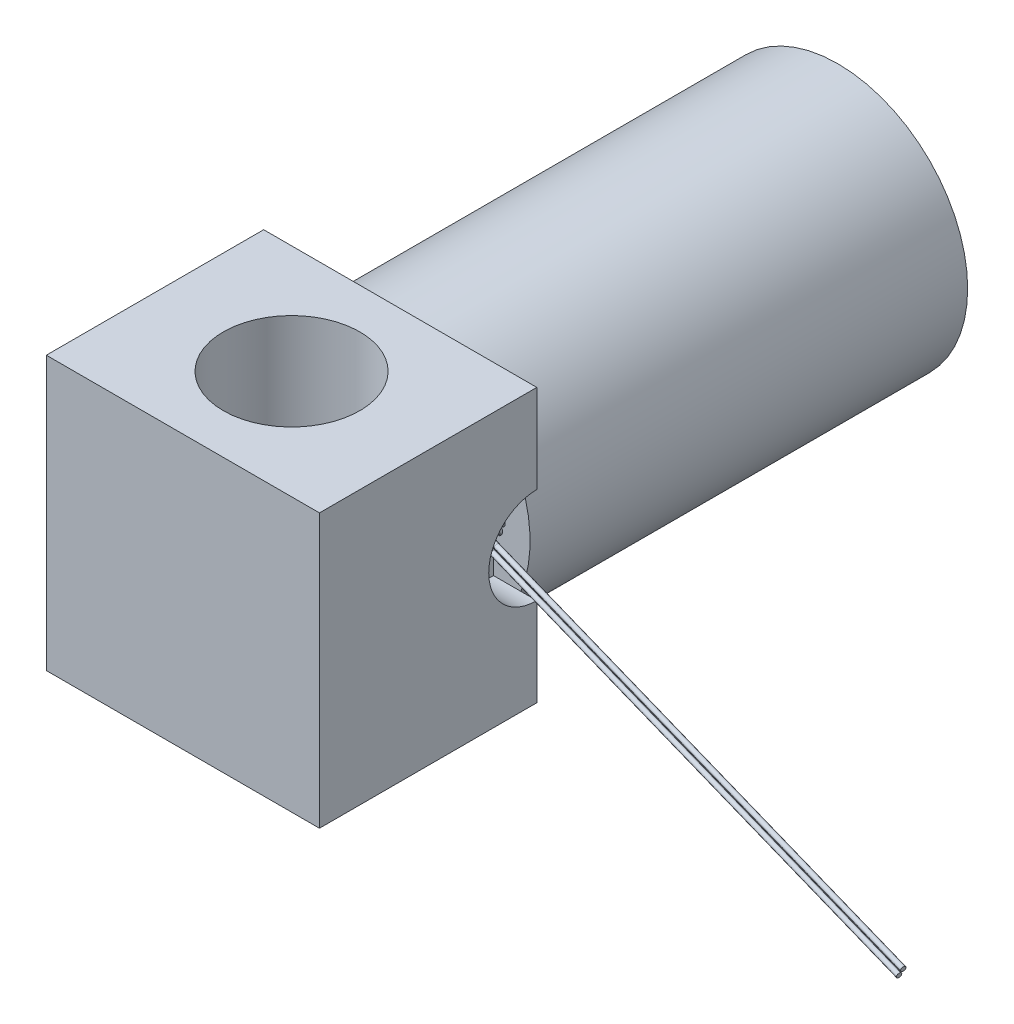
ISO-10303-21;
HEADER;
FILE_DESCRIPTION(('STEP AP214'),'2;1');
FILE_NAME('part.step','',(''),(''),'','','');
FILE_SCHEMA(('AUTOMOTIVE_DESIGN { 1 0 10303 214 1 1 1 1 }'));
ENDSEC;
DATA;
#1=APPLICATION_CONTEXT('core data for automotive mechanical design processes');
#2=APPLICATION_PROTOCOL_DEFINITION('international standard','automotive_design',2000,#1);
#3=PRODUCT_CONTEXT('',#1,'mechanical');
#4=PRODUCT('Part','Part','',(#3));
#5=PRODUCT_RELATED_PRODUCT_CATEGORY('part','',(#4));
#6=PRODUCT_DEFINITION_FORMATION('','',#4);
#7=PRODUCT_DEFINITION_CONTEXT('part definition',#1,'design');
#8=PRODUCT_DEFINITION('design','',#6,#7);
#9=PRODUCT_DEFINITION_SHAPE('','',#8);
#10=(LENGTH_UNIT() NAMED_UNIT(*) SI_UNIT(.MILLI.,.METRE.));
#11=(NAMED_UNIT(*) PLANE_ANGLE_UNIT() SI_UNIT($,.RADIAN.));
#12=(NAMED_UNIT(*) SI_UNIT($,.STERADIAN.) SOLID_ANGLE_UNIT());
#13=UNCERTAINTY_MEASURE_WITH_UNIT(LENGTH_MEASURE(1.E-05),#10,'distance_accuracy_value','');
#14=(GEOMETRIC_REPRESENTATION_CONTEXT(3) GLOBAL_UNCERTAINTY_ASSIGNED_CONTEXT((#13)) GLOBAL_UNIT_ASSIGNED_CONTEXT((#10,
#11,#12)) REPRESENTATION_CONTEXT('',''));
#15=CARTESIAN_POINT('',(0.,0.,0.));
#16=DIRECTION('',(0.,0.,1.));
#17=DIRECTION('',(1.,0.,0.));
#18=AXIS2_PLACEMENT_3D('',#15,#16,#17);
#19=CARTESIAN_POINT('',(0.,3.6068,2.8702));
#20=DIRECTION('',(0.,1.,0.));
#21=DIRECTION('',(0.,0.,1.));
#22=AXIS2_PLACEMENT_3D('',#19,#20,#21);
#23=CYLINDRICAL_SURFACE('',#22,1.8034);
#24=CARTESIAN_POINT('',(0.,-3.6068,2.8702));
#25=DIRECTION('',(0.,1.,0.));
#26=DIRECTION('',(0.,0.,1.));
#27=AXIS2_PLACEMENT_3D('',#24,#25,#26);
#28=CIRCLE('',#27,1.8034);
#29=CARTESIAN_POINT('',(0.,-3.6068,4.6736));
#30=VERTEX_POINT('',#29);
#31=EDGE_CURVE('P0_E150',#30,#30,#28,.T.);
#32=ORIENTED_EDGE('',*,*,#31,.F.);
#33=EDGE_LOOP('',(#32));
#34=FACE_BOUND('',#33,.T.);
#35=CARTESIAN_POINT('',(0.,3.6068,2.8702));
#36=DIRECTION('',(0.,1.,0.));
#37=DIRECTION('',(0.,0.,1.));
#38=AXIS2_PLACEMENT_3D('',#35,#36,#37);
#39=CIRCLE('',#38,1.8034);
#40=CARTESIAN_POINT('',(0.,3.6068,4.6736));
#41=VERTEX_POINT('',#40);
#42=EDGE_CURVE('P0_E144',#41,#41,#39,.T.);
#43=ORIENTED_EDGE('',*,*,#42,.T.);
#44=EDGE_LOOP('',(#43));
#45=FACE_BOUND('',#44,.T.);
#46=ADVANCED_FACE('P0_F35',(#34,#45),#23,.F.);
#47=CARTESIAN_POINT('',(0.,0.,5.7404));
#48=DIRECTION('',(0.,0.,1.));
#49=DIRECTION('',(1.,0.,0.));
#50=AXIS2_PLACEMENT_3D('',#47,#48,#49);
#51=PLANE('',#50);
#52=DIRECTION('',(0.,1.,0.));
#53=VECTOR('',#52,1.);
#54=CARTESIAN_POINT('',(3.6068,3.6068,5.7404));
#55=LINE('',#54,#53);
#56=CARTESIAN_POINT('',(3.6068,-3.6068,5.7404));
#57=VERTEX_POINT('',#56);
#58=CARTESIAN_POINT('',(3.6068,3.6068,5.7404));
#59=VERTEX_POINT('',#58);
#60=EDGE_CURVE('P0_E154',#57,#59,#55,.T.);
#61=ORIENTED_EDGE('',*,*,#60,.T.);
#62=DIRECTION('',(-1.,0.,0.));
#63=VECTOR('',#62,1.);
#64=CARTESIAN_POINT('',(-3.6068,3.6068,5.7404));
#65=LINE('',#64,#63);
#66=CARTESIAN_POINT('',(-3.6068,3.6068,5.7404));
#67=VERTEX_POINT('',#66);
#68=EDGE_CURVE('P0_E89',#59,#67,#65,.T.);
#69=ORIENTED_EDGE('',*,*,#68,.T.);
#70=DIRECTION('',(0.,-1.,0.));
#71=VECTOR('',#70,1.);
#72=CARTESIAN_POINT('',(-3.6068,3.6068,5.7404));
#73=LINE('',#72,#71);
#74=CARTESIAN_POINT('',(-3.6068,-3.6068,5.7404));
#75=VERTEX_POINT('',#74);
#76=EDGE_CURVE('P0_E157',#67,#75,#73,.T.);
#77=ORIENTED_EDGE('',*,*,#76,.T.);
#78=DIRECTION('',(1.,0.,0.));
#79=VECTOR('',#78,1.);
#80=CARTESIAN_POINT('',(-3.6068,-3.6068,5.7404));
#81=LINE('',#80,#79);
#82=EDGE_CURVE('P0_E57',#75,#57,#81,.T.);
#83=ORIENTED_EDGE('',*,*,#82,.T.);
#84=EDGE_LOOP('',(#61,#69,#77,#83));
#85=FACE_BOUND('',#84,.T.);
#86=ADVANCED_FACE('P0_F212',(#85),#51,.T.);
#87=CARTESIAN_POINT('',(-3.6068,3.6068,5.7404));
#88=DIRECTION('',(0.,-1.,0.));
#89=DIRECTION('',(0.,0.,-1.));
#90=AXIS2_PLACEMENT_3D('',#87,#88,#89);
#91=PLANE('',#90);
#92=ORIENTED_EDGE('',*,*,#42,.F.);
#93=EDGE_LOOP('',(#92));
#94=FACE_BOUND('',#93,.T.);
#95=DIRECTION('',(-1.,0.,0.));
#96=VECTOR('',#95,1.);
#97=CARTESIAN_POINT('',(-3.6068,3.6068,0.));
#98=LINE('',#97,#96);
#99=CARTESIAN_POINT('',(3.6068,3.6068,0.));
#100=VERTEX_POINT('',#99);
#101=CARTESIAN_POINT('',(-3.6068,3.6068,0.));
#102=VERTEX_POINT('',#101);
#103=EDGE_CURVE('P0_E164',#100,#102,#98,.T.);
#104=ORIENTED_EDGE('',*,*,#103,.T.);
#105=DIRECTION('',(0.,0.,-1.));
#106=VECTOR('',#105,1.);
#107=CARTESIAN_POINT('',(-3.6068,3.6068,5.7404));
#108=LINE('',#107,#106);
#109=EDGE_CURVE('P0_E171',#67,#102,#108,.T.);
#110=ORIENTED_EDGE('',*,*,#109,.F.);
#111=ORIENTED_EDGE('',*,*,#68,.F.);
#112=DIRECTION('',(0.,0.,-1.));
#113=VECTOR('',#112,1.);
#114=CARTESIAN_POINT('',(3.6068,3.6068,5.7404));
#115=LINE('',#114,#113);
#116=EDGE_CURVE('P0_E173',#59,#100,#115,.T.);
#117=ORIENTED_EDGE('',*,*,#116,.T.);
#118=EDGE_LOOP('',(#104,#110,#111,#117));
#119=FACE_BOUND('',#118,.T.);
#120=ADVANCED_FACE('P0_F220',(#94,#119),#91,.F.);
#121=CARTESIAN_POINT('',(-3.6068,3.6068,5.7404));
#122=DIRECTION('',(1.,0.,0.));
#123=DIRECTION('',(0.,1.,0.));
#124=AXIS2_PLACEMENT_3D('',#121,#122,#123);
#125=PLANE('',#124);
#126=DIRECTION('',(0.,-1.,0.));
#127=VECTOR('',#126,1.);
#128=CARTESIAN_POINT('',(-3.6068,3.6068,0.));
#129=LINE('',#128,#127);
#130=CARTESIAN_POINT('',(-3.6068,-3.6068,0.));
#131=VERTEX_POINT('',#130);
#132=EDGE_CURVE('P0_E75',#102,#131,#129,.T.);
#133=ORIENTED_EDGE('',*,*,#132,.T.);
#134=DIRECTION('',(0.,0.,-1.));
#135=VECTOR('',#134,1.);
#136=CARTESIAN_POINT('',(-3.6068,-3.6068,5.7404));
#137=LINE('',#136,#135);
#138=EDGE_CURVE('P0_E169',#75,#131,#137,.T.);
#139=ORIENTED_EDGE('',*,*,#138,.F.);
#140=ORIENTED_EDGE('',*,*,#76,.F.);
#141=ORIENTED_EDGE('',*,*,#109,.T.);
#142=EDGE_LOOP('',(#133,#139,#140,#141));
#143=FACE_BOUND('',#142,.T.);
#144=ADVANCED_FACE('P0_F233',(#143),#125,.F.);
#145=CARTESIAN_POINT('',(-3.6068,-3.6068,5.7404));
#146=DIRECTION('',(0.,1.,0.));
#147=DIRECTION('',(0.,0.,1.));
#148=AXIS2_PLACEMENT_3D('',#145,#146,#147);
#149=PLANE('',#148);
#150=ORIENTED_EDGE('',*,*,#31,.T.);
#151=EDGE_LOOP('',(#150));
#152=FACE_BOUND('',#151,.T.);
#153=DIRECTION('',(1.,0.,0.));
#154=VECTOR('',#153,1.);
#155=CARTESIAN_POINT('',(-3.6068,-3.6068,0.));
#156=LINE('',#155,#154);
#157=CARTESIAN_POINT('',(3.6068,-3.6068,0.));
#158=VERTEX_POINT('',#157);
#159=EDGE_CURVE('P0_E81',#131,#158,#156,.T.);
#160=ORIENTED_EDGE('',*,*,#159,.T.);
#161=DIRECTION('',(0.,0.,-1.));
#162=VECTOR('',#161,1.);
#163=CARTESIAN_POINT('',(3.6068,-3.6068,5.7404));
#164=LINE('',#163,#162);
#165=EDGE_CURVE('P0_E160',#57,#158,#164,.T.);
#166=ORIENTED_EDGE('',*,*,#165,.F.);
#167=ORIENTED_EDGE('',*,*,#82,.F.);
#168=ORIENTED_EDGE('',*,*,#138,.T.);
#169=EDGE_LOOP('',(#160,#166,#167,#168));
#170=FACE_BOUND('',#169,.T.);
#171=ADVANCED_FACE('P0_F230',(#152,#170),#149,.F.);
#172=CARTESIAN_POINT('',(3.6068,3.6068,5.7404));
#173=DIRECTION('',(-1.,0.,0.));
#174=DIRECTION('',(0.,-1.,0.));
#175=AXIS2_PLACEMENT_3D('',#172,#173,#174);
#176=PLANE('',#175);
#177=DIRECTION('',(0.,1.,0.));
#178=VECTOR('',#177,1.);
#179=CARTESIAN_POINT('',(3.6068,3.6068,0.));
#180=LINE('',#179,#178);
#181=CARTESIAN_POINT('',(3.6068,-1.27,0.));
#182=VERTEX_POINT('',#181);
#183=EDGE_CURVE('P0_E161',#158,#182,#180,.T.);
#184=ORIENTED_EDGE('',*,*,#183,.T.);
#185=CARTESIAN_POINT('',(3.6068,0.,0.));
#186=DIRECTION('',(1.,0.,0.));
#187=DIRECTION('',(0.,1.,0.));
#188=AXIS2_PLACEMENT_3D('',#185,#186,#187);
#189=CIRCLE('',#188,1.27);
#190=CARTESIAN_POINT('',(3.6068,1.27,0.));
#191=VERTEX_POINT('',#190);
#192=EDGE_CURVE('P0_E132',#191,#182,#189,.T.);
#193=ORIENTED_EDGE('',*,*,#192,.F.);
#194=EDGE_CURVE('P0_E153',#191,#100,#180,.T.);
#195=ORIENTED_EDGE('',*,*,#194,.T.);
#196=ORIENTED_EDGE('',*,*,#116,.F.);
#197=ORIENTED_EDGE('',*,*,#60,.F.);
#198=ORIENTED_EDGE('',*,*,#165,.T.);
#199=EDGE_LOOP('',(#184,#193,#195,#196,#197,#198));
#200=FACE_BOUND('',#199,.T.);
#201=ADVANCED_FACE('P0_F37',(#200),#176,.F.);
#202=CARTESIAN_POINT('',(2.4638,0.,0.));
#203=DIRECTION('',(1.,0.,0.));
#204=DIRECTION('',(0.,1.,0.));
#205=AXIS2_PLACEMENT_3D('',#202,#203,#204);
#206=PLANE('',#205);
#207=DIRECTION('',(0.,1.,0.));
#208=VECTOR('',#207,1.);
#209=CARTESIAN_POINT('',(2.4638,0.,0.));
#210=LINE('',#209,#208);
#211=CARTESIAN_POINT('',(2.4638,-1.27,0.));
#212=VERTEX_POINT('',#211);
#213=CARTESIAN_POINT('',(2.4638,1.27,0.));
#214=VERTEX_POINT('',#213);
#215=EDGE_CURVE('P0_E133',#212,#214,#210,.T.);
#216=ORIENTED_EDGE('',*,*,#215,.T.);
#217=CARTESIAN_POINT('',(2.4638,0.,0.));
#218=DIRECTION('',(1.,0.,0.));
#219=DIRECTION('',(0.,1.,0.));
#220=AXIS2_PLACEMENT_3D('',#217,#218,#219);
#221=CIRCLE('',#220,1.27);
#222=EDGE_CURVE('P0_E136',#214,#212,#221,.T.);
#223=ORIENTED_EDGE('',*,*,#222,.T.);
#224=EDGE_LOOP('',(#216,#223));
#225=FACE_BOUND('',#224,.T.);
#226=ADVANCED_FACE('P0_F259',(#225),#206,.T.);
#227=CARTESIAN_POINT('',(2.4638,0.,0.));
#228=DIRECTION('',(1.,0.,0.));
#229=DIRECTION('',(0.,1.,0.));
#230=AXIS2_PLACEMENT_3D('',#227,#228,#229);
#231=CYLINDRICAL_SURFACE('',#230,1.27);
#232=ORIENTED_EDGE('',*,*,#192,.T.);
#233=DIRECTION('',(1.,0.,0.));
#234=VECTOR('',#233,1.);
#235=CARTESIAN_POINT('',(2.4638,-1.27,0.));
#236=LINE('',#235,#234);
#237=CARTESIAN_POINT('',(3.18514379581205,-1.27,0.));
#238=VERTEX_POINT('',#237);
#239=EDGE_CURVE('P0_E145',#238,#182,#236,.T.);
#240=ORIENTED_EDGE('',*,*,#239,.F.);
#241=EDGE_CURVE('P0_E142',#212,#238,#236,.T.);
#242=ORIENTED_EDGE('',*,*,#241,.F.);
#243=ORIENTED_EDGE('',*,*,#222,.F.);
#244=DIRECTION('',(1.,0.,0.));
#245=VECTOR('',#244,1.);
#246=CARTESIAN_POINT('',(2.4638,1.27,0.));
#247=LINE('',#246,#245);
#248=CARTESIAN_POINT('',(3.18514379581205,1.27,0.));
#249=VERTEX_POINT('',#248);
#250=EDGE_CURVE('P0_E146',#214,#249,#247,.T.);
#251=ORIENTED_EDGE('',*,*,#250,.T.);
#252=EDGE_CURVE('P0_E139',#249,#191,#247,.T.);
#253=ORIENTED_EDGE('',*,*,#252,.T.);
#254=EDGE_LOOP('',(#232,#240,#242,#243,#251,#253));
#255=FACE_BOUND('',#254,.T.);
#256=ADVANCED_FACE('P0_F228',(#255),#231,.F.);
#257=CARTESIAN_POINT('',(0.,0.,0.));
#258=DIRECTION('',(0.,0.,1.));
#259=DIRECTION('',(1.,0.,0.));
#260=AXIS2_PLACEMENT_3D('',#257,#258,#259);
#261=PLANE('',#260);
#262=ORIENTED_EDGE('',*,*,#252,.F.);
#263=CARTESIAN_POINT('',(0.,0.,0.));
#264=DIRECTION('',(0.,0.,1.));
#265=DIRECTION('',(1.,0.,0.));
#266=AXIS2_PLACEMENT_3D('',#263,#264,#265);
#267=CIRCLE('',#266,3.429);
#268=EDGE_CURVE('P0_E129',#238,#249,#267,.F.);
#269=ORIENTED_EDGE('',*,*,#268,.F.);
#270=ORIENTED_EDGE('',*,*,#239,.T.);
#271=ORIENTED_EDGE('',*,*,#183,.F.);
#272=ORIENTED_EDGE('',*,*,#159,.F.);
#273=ORIENTED_EDGE('',*,*,#132,.F.);
#274=ORIENTED_EDGE('',*,*,#103,.F.);
#275=ORIENTED_EDGE('',*,*,#194,.F.);
#276=EDGE_LOOP('',(#262,#269,#270,#271,#272,#273,#274,#275));
#277=FACE_BOUND('',#276,.T.);
#278=ADVANCED_FACE('P0_F207',(#277),#261,.F.);
#279=CARTESIAN_POINT('',(0.,0.,0.));
#280=DIRECTION('',(0.,0.,1.));
#281=DIRECTION('',(1.,0.,0.));
#282=AXIS2_PLACEMENT_3D('',#279,#280,#281);
#283=PLANE('',#282);
#284=CARTESIAN_POINT('',(2.76681599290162,0.0278101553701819,0.));
#285=CARTESIAN_POINT('',(2.77091042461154,0.040406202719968,-5.43198032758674E-13));
#286=CARTESIAN_POINT('',(2.77305541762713,0.0537628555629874,-5.9329812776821E-12));
#287=CARTESIAN_POINT('',(2.77234776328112,0.0763716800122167,4.15946924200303E-12));
#288=CARTESIAN_POINT('',(2.77079745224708,0.0856571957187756,1.38837417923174E-11));
#289=CARTESIAN_POINT('',(2.76520482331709,0.101158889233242,1.36565932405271E-11));
#290=CARTESIAN_POINT('',(2.76181676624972,0.107590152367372,7.71183955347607E-12));
#291=CARTESIAN_POINT('',(2.75372780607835,0.117825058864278,1.17997632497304E-11));
#292=CARTESIAN_POINT('',(2.74937547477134,0.121893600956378,1.91355510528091E-11));
#293=CARTESIAN_POINT('',(2.73945791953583,0.128248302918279,3.0276541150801E-11));
#294=CARTESIAN_POINT('',(2.73388776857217,0.130527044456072,3.40670613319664E-11));
#295=CARTESIAN_POINT('',(2.7228472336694,0.132767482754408,2.10973642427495E-11));
#296=CARTESIAN_POINT('',(2.71741361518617,0.132920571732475,6.16973150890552E-12));
#297=CARTESIAN_POINT('',(2.70655604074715,0.131579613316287,-5.11036407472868E-12));
#298=CARTESIAN_POINT('',(2.70114163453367,0.13001770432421,-6.75296670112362E-13));
#299=CARTESIAN_POINT('',(2.68849934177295,0.124533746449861,4.74264848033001E-12));
#300=CARTESIAN_POINT('',(2.68161658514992,0.119847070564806,3.11998107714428E-12));
#301=CARTESIAN_POINT('',(2.66735000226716,0.106908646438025,6.14048409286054E-13));
#302=CARTESIAN_POINT('',(2.66060794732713,0.0979851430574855,1.77009033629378E-13));
#303=CARTESIAN_POINT('',(2.64977008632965,0.078451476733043,-1.81621747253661E-13));
#304=CARTESIAN_POINT('',(2.64574535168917,0.0678044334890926,0.));
#305=CARTESIAN_POINT('',(2.64004189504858,0.0433939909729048,1.11179361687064E-13));
#306=CARTESIAN_POINT('',(2.63905363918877,0.0294527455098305,2.20162759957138E-13));
#307=CARTESIAN_POINT('',(2.64179370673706,0.00690643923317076,-1.4358525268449E-13));
#308=CARTESIAN_POINT('',(2.64399835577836,-0.00186511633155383,-4.26828798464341E-13));
#309=CARTESIAN_POINT('',(2.65041320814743,-0.0160573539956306,0.));
#310=CARTESIAN_POINT('',(2.6539518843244,-0.0217559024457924,4.83671488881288E-13));
#311=CARTESIAN_POINT('',(2.66198517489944,-0.0305343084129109,0.));
#312=CARTESIAN_POINT('',(2.66613940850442,-0.0339109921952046,-8.09288977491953E-13));
#313=CARTESIAN_POINT('',(2.67542960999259,-0.0389742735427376,-1.045898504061E-12));
#314=CARTESIAN_POINT('',(2.68056968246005,-0.0406536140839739,-5.35560102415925E-13));
#315=CARTESIAN_POINT('',(2.6906301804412,-0.0419975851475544,6.44199298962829E-13));
#316=CARTESIAN_POINT('',(2.69553215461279,-0.0418212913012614,1.29641698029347E-12));
#317=CARTESIAN_POINT('',(2.70687405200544,-0.0398214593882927,-3.0703462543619E-12));
#318=CARTESIAN_POINT('',(2.71319821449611,-0.0374027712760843,-1.03167940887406E-11));
#319=CARTESIAN_POINT('',(2.72733286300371,-0.0296794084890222,-1.37096577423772E-11));
#320=CARTESIAN_POINT('',(2.73468075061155,-0.0235959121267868,-4.04606235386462E-12));
#321=CARTESIAN_POINT('',(2.7499159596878,-0.0071554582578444,5.55813542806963E-12));
#322=CARTESIAN_POINT('',(2.75697851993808,0.00394890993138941,5.15024257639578E-13));
#323=CARTESIAN_POINT('',(2.7639457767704,0.0196954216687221,-1.59480911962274E-13));
#324=CARTESIAN_POINT('',(2.76548403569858,0.0237125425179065,1.76707436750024E-13));
#325=CARTESIAN_POINT('',(2.76681599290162,0.0278101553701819,0.));
#326=B_SPLINE_CURVE_WITH_KNOTS('',3,(#284,#285,#286,#287,#288,#289,#290,#291,#292,#293,#294,
#295,#296,#297,#298,#299,#300,#301,#302,#303,#304,#305,#306,#307,#308,#309,#310,#311,#312,#313,
#314,#315,#316,#317,#318,#319,#320,#321,#322,#323,#324,#325),.UNSPECIFIED.,.T.,.F.,(4,2,2,2,2,2,
2,2,2,2,2,2,2,2,2,2,2,2,2,2,4),(0.,0.0396735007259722,0.0674866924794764,0.0889107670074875,
0.106457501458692,0.124076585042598,0.14009778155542,0.15677653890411,0.181301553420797,
0.214261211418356,0.248052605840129,0.289109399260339,0.315858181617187,0.335643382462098,
0.35140805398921,0.367239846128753,0.381726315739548,0.401666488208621,0.429829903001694,
0.468519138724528,0.48142530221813),.UNSPECIFIED.);
#327=CARTESIAN_POINT('',(2.76681599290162,0.0278101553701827,0.));
#328=VERTEX_POINT('',#327);
#329=EDGE_CURVE('P0_E11',#328,#328,#326,.T.);
#330=ORIENTED_EDGE('',*,*,#329,.F.);
#331=EDGE_LOOP('',(#330));
#332=FACE_BOUND('',#331,.T.);
#333=CARTESIAN_POINT('',(2.69561797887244,-0.191331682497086,0.));
#334=CARTESIAN_POINT('',(2.69844209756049,-0.182637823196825,4.68928398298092E-13));
#335=CARTESIAN_POINT('',(2.70058964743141,-0.173725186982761,1.37375686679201E-12));
#336=CARTESIAN_POINT('',(2.70327090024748,-0.15566257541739,-1.37057502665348E-12));
#337=CARTESIAN_POINT('',(2.70380832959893,-0.146513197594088,-5.00919247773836E-12));
#338=CARTESIAN_POINT('',(2.70281104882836,-0.128563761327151,4.85203016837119E-12));
#339=CARTESIAN_POINT('',(2.70134094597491,-0.119761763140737,1.78167131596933E-11));
#340=CARTESIAN_POINT('',(2.69619068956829,-0.104580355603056,-8.5260548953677E-12));
#341=CARTESIAN_POINT('',(2.69298502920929,-0.098058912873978,-3.83439666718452E-11));
#342=CARTESIAN_POINT('',(2.68543135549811,-0.0880773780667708,2.86055247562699E-11));
#343=CARTESIAN_POINT('',(2.68158024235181,-0.0842604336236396,9.51469601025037E-11));
#344=CARTESIAN_POINT('',(2.67269858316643,-0.0782277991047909,9.27424801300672E-11));
#345=CARTESIAN_POINT('',(2.66766145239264,-0.0760213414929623,2.30236739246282E-11));
#346=CARTESIAN_POINT('',(2.65775438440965,-0.0738330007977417,-2.03799030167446E-11));
#347=CARTESIAN_POINT('',(2.65293166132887,-0.0736247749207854,-4.17244677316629E-12));
#348=CARTESIAN_POINT('',(2.64327043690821,-0.0746488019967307,7.72113869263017E-12));
#349=CARTESIAN_POINT('',(2.63843953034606,-0.0759409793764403,2.53093021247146E-12));
#350=CARTESIAN_POINT('',(2.62643746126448,-0.0807601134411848,3.4769261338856E-12));
#351=CARTESIAN_POINT('',(2.61964144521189,-0.0851704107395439,1.84789345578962E-11));
#352=CARTESIAN_POINT('',(2.6043142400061,-0.0981614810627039,2.7286113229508E-11));
#353=CARTESIAN_POINT('',(2.5966753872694,-0.107721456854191,6.31134377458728E-12));
#354=CARTESIAN_POINT('',(2.58568267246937,-0.125667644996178,-4.69175841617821E-12));
#355=CARTESIAN_POINT('',(2.58173223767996,-0.133725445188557,-1.28063411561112E-12));
#356=CARTESIAN_POINT('',(2.57515365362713,-0.150367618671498,1.28023644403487E-12));
#357=CARTESIAN_POINT('',(2.57252509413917,-0.158951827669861,4.31305647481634E-13));
#358=CARTESIAN_POINT('',(2.56850611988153,-0.17668115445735,-4.15724958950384E-13));
#359=CARTESIAN_POINT('',(2.56715688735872,-0.185835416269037,-3.86456721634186E-13));
#360=CARTESIAN_POINT('',(2.56597156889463,-0.204220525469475,3.84628417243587E-13));
#361=CARTESIAN_POINT('',(2.56612835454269,-0.213450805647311,1.12307363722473E-12));
#362=CARTESIAN_POINT('',(2.56816481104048,-0.230377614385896,-9.68179766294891E-13));
#363=CARTESIAN_POINT('',(2.56979388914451,-0.238104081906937,-3.30080892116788E-12));
#364=CARTESIAN_POINT('',(2.57511101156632,-0.25308323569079,3.08820337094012E-12));
#365=CARTESIAN_POINT('',(2.57881776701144,-0.260330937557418,1.19112303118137E-11));
#366=CARTESIAN_POINT('',(2.58685563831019,-0.269507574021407,-6.34470993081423E-12));
#367=CARTESIAN_POINT('',(2.59008539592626,-0.272339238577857,-1.85723181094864E-11));
#368=CARTESIAN_POINT('',(2.5973965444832,-0.276696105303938,-1.83629604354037E-11));
#369=CARTESIAN_POINT('',(2.60148295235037,-0.278213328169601,-5.77685269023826E-12));
#370=CARTESIAN_POINT('',(2.60949747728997,-0.279568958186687,5.97768325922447E-12));
#371=CARTESIAN_POINT('',(2.61340368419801,-0.279553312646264,6.30841263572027E-12));
#372=CARTESIAN_POINT('',(2.62281367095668,-0.278244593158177,-7.57394778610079E-12));
#373=CARTESIAN_POINT('',(2.62822223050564,-0.276364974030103,-2.85734963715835E-11));
#374=CARTESIAN_POINT('',(2.6373971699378,-0.271838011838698,-2.40980208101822E-11));
#375=CARTESIAN_POINT('',(2.64128152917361,-0.269399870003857,-6.57700420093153E-12));
#376=CARTESIAN_POINT('',(2.6486549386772,-0.263976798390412,6.58865052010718E-12));
#377=CARTESIAN_POINT('',(2.65214327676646,-0.260990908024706,2.19449579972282E-12));
#378=CARTESIAN_POINT('',(2.66113329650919,-0.252351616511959,-3.77603173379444E-12));
#379=CARTESIAN_POINT('',(2.66627426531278,-0.246326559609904,-1.0397015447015E-12));
#380=CARTESIAN_POINT('',(2.67558635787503,-0.233592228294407,1.03973805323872E-12));
#381=CARTESIAN_POINT('',(2.67975744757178,-0.226882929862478,3.82728307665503E-13));
#382=CARTESIAN_POINT('',(2.68833988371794,-0.210774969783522,-5.02960330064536E-13));
#383=CARTESIAN_POINT('',(2.69241426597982,-0.201194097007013,-5.319577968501E-13));
#384=CARTESIAN_POINT('',(2.69561797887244,-0.191331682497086,0.));
#385=B_SPLINE_CURVE_WITH_KNOTS('',3,(#333,#334,#335,#336,#337,#338,#339,#340,#341,#342,#343,
#344,#345,#346,#347,#348,#349,#350,#351,#352,#353,#354,#355,#356,#357,#358,#359,#360,#361,#362,
#363,#364,#365,#366,#367,#368,#369,#370,#371,#372,#373,#374,#375,#376,#377,#378,#379,#380,#381,
#382,#383,#384),.UNSPECIFIED.,.T.,.F.,(4,2,2,2,2,2,2,2,2,2,2,2,2,2,2,2,2,2,2,2,2,2,2,2,2,4),(0.,
0.0273860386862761,0.0547086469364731,0.0811723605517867,0.102593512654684,0.118574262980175,
0.13464592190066,0.148872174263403,0.163686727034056,0.187559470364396,0.223651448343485,
0.25048089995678,0.277302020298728,0.304959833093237,0.332486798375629,0.356061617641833,
0.379852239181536,0.392524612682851,0.405273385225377,0.416809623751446,0.433672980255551,
0.447383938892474,0.461119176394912,0.484752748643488,0.508387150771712,0.539454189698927),.UNSPECIFIED.);
#386=CARTESIAN_POINT('',(2.69561797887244,-0.191331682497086,0.));
#387=VERTEX_POINT('',#386);
#388=EDGE_CURVE('P0_E49',#387,#387,#385,.T.);
#389=ORIENTED_EDGE('',*,*,#388,.F.);
#390=EDGE_LOOP('',(#389));
#391=FACE_BOUND('',#390,.T.);
#392=EDGE_CURVE('P0_E128',#249,#238,#267,.F.);
#393=ORIENTED_EDGE('',*,*,#392,.F.);
#394=ORIENTED_EDGE('',*,*,#250,.F.);
#395=ORIENTED_EDGE('',*,*,#215,.F.);
#396=ORIENTED_EDGE('',*,*,#241,.T.);
#397=EDGE_LOOP('',(#393,#394,#395,#396));
#398=FACE_BOUND('',#397,.T.);
#399=ADVANCED_FACE('P0_F179',(#332,#391,#398),#283,.T.);
#400=CARTESIAN_POINT('',(0.,0.,9.69867661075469));
#401=DIRECTION('',(0.,0.,-1.));
#402=DIRECTION('',(-1.,0.,0.));
#403=AXIS2_PLACEMENT_3D('',#400,#401,#402);
#404=CYLINDRICAL_SURFACE('',#403,3.429);
#405=CARTESIAN_POINT('',(0.,0.,-11.557));
#406=DIRECTION('',(0.,0.,-1.));
#407=DIRECTION('',(-1.,0.,0.));
#408=AXIS2_PLACEMENT_3D('',#405,#406,#407);
#409=CIRCLE('',#408,3.429);
#410=CARTESIAN_POINT('',(-3.429,0.,-11.557));
#411=VERTEX_POINT('',#410);
#412=EDGE_CURVE('P0_E119',#411,#411,#409,.T.);
#413=ORIENTED_EDGE('',*,*,#412,.F.);
#414=EDGE_LOOP('',(#413));
#415=FACE_BOUND('',#414,.T.);
#416=ORIENTED_EDGE('',*,*,#268,.T.);
#417=ORIENTED_EDGE('',*,*,#392,.T.);
#418=EDGE_LOOP('',(#416,#417));
#419=FACE_BOUND('',#418,.T.);
#420=ADVANCED_FACE('P0_F193',(#415,#419),#404,.T.);
#421=CARTESIAN_POINT('',(0.,0.,-11.557));
#422=DIRECTION('',(0.,0.,-1.));
#423=DIRECTION('',(-1.,0.,0.));
#424=AXIS2_PLACEMENT_3D('',#421,#422,#423);
#425=PLANE('',#424);
#426=ORIENTED_EDGE('',*,*,#412,.T.);
#427=EDGE_LOOP('',(#426));
#428=FACE_BOUND('',#427,.T.);
#429=ADVANCED_FACE('P0_F190',(#428),#425,.T.);
#430=CARTESIAN_POINT('',(2.4967756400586,-0.803325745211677,-0.225668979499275));
#431=CARTESIAN_POINT('',(2.62265504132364,-0.415913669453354,-0.214608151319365));
#432=CARTESIAN_POINT('',(2.73006062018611,-0.0853301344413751,-0.00192376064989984));
#433=CARTESIAN_POINT('',(2.79038891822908,0.100386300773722,0.355743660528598));
#434=CARTESIAN_POINT('',(2.4967756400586,-0.803325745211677,-0.352668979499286));
#435=CARTESIAN_POINT('',(2.63697060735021,-0.371855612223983,-0.341608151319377));
#436=CARTESIAN_POINT('',(2.75678463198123,-0.00308033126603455,-0.105826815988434));
#437=CARTESIAN_POINT('',(2.82430973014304,0.204790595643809,0.291883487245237));
#438=CARTESIAN_POINT('',(2.37599146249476,-0.76408058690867,-0.352668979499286));
#439=CARTESIAN_POINT('',(2.51618583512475,-0.332612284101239,-0.341608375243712));
#440=CARTESIAN_POINT('',(2.63599937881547,0.0361615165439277,-0.105828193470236));
#441=CARTESIAN_POINT('',(2.70352423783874,0.244031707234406,0.291880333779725));
#442=CARTESIAN_POINT('',(2.37599146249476,-0.76408058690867,-0.225668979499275));
#443=CARTESIAN_POINT('',(2.50187026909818,-0.37667034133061,-0.214608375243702));
#444=CARTESIAN_POINT('',(2.60927536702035,-0.0460882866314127,-0.00192513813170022));
#445=CARTESIAN_POINT('',(2.66960342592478,0.13962741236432,0.355740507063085));
#446=CARTESIAN_POINT('',(2.37599146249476,-0.76408058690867,-0.0986689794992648));
#447=CARTESIAN_POINT('',(2.48755470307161,-0.420728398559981,-0.0876083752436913));
#448=CARTESIAN_POINT('',(2.58255135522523,-0.128338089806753,0.101977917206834));
#449=CARTESIAN_POINT('',(2.63568261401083,0.0352231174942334,0.419600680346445));
#450=CARTESIAN_POINT('',(2.4967756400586,-0.803325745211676,-0.0986689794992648));
#451=CARTESIAN_POINT('',(2.60833947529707,-0.459971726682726,-0.0876081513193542));
#452=CARTESIAN_POINT('',(2.703336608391,-0.167579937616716,0.101979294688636));
#453=CARTESIAN_POINT('',(2.75646810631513,-0.00401799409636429,0.419603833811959));
#454=CARTESIAN_POINT('',(2.4967756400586,-0.803325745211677,-0.225668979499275));
#455=CARTESIAN_POINT('',(2.62265504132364,-0.415913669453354,-0.214608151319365));
#456=CARTESIAN_POINT('',(2.73006062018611,-0.0853301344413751,-0.00192376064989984));
#457=CARTESIAN_POINT('',(2.79038891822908,0.100386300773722,0.355743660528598));
#458=(BOUNDED_SURFACE() B_SPLINE_SURFACE(3,3,((#430,#431,#432,#433),(#434,#435,#436,#437),(#438,
#439,#440,#441),(#442,#443,#444,#445),(#446,#447,#448,#449),(#450,#451,#452,#453),(#454,#455,
#456,#457)),.UNSPECIFIED.,.T.,.F.,.F.) B_SPLINE_SURFACE_WITH_KNOTS((4,3,4),(4,4),(0.,0.5,1.),
(0.,1.),.UNSPECIFIED.) GEOMETRIC_REPRESENTATION_ITEM() RATIONAL_B_SPLINE_SURFACE(((1.,
0.911229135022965,0.911229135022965,1.),(0.333333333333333,0.303743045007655,0.303743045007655,
0.333333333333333),(0.333333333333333,0.303743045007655,0.303743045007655,0.333333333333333),
(1.,0.911229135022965,0.911229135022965,1.),(0.333333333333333,0.303743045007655,
0.303743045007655,0.333333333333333),(0.333333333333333,0.303743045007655,0.303743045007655,
0.333333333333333),(1.,0.911229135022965,0.911229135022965,1.))) REPRESENTATION_ITEM('') SURFACE());
#459=CARTESIAN_POINT('',(2.72999617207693,0.12000685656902,0.355742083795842));
#460=DIRECTION('',(0.155348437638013,0.478237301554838,0.864381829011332));
#461=DIRECTION('',(0.951066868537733,-0.308985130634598,2.4830437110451E-05));
#462=AXIS2_PLACEMENT_3D('',#459,#460,#461);
#463=CIRCLE('',#462,0.0635000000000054);
#464=CARTESIAN_POINT('',(2.79038891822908,0.100386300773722,0.355743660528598));
#465=VERTEX_POINT('',#464);
#466=EDGE_CURVE('P0_E115',#465,#465,#463,.T.);
#467=CARTESIAN_POINT('',(2.69561797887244,-0.191331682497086,0.));
#468=CARTESIAN_POINT('',(2.69686420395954,-0.187495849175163,0.00304982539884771));
#469=CARTESIAN_POINT('',(2.69810402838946,-0.183679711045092,0.00612703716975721));
#470=CARTESIAN_POINT('',(2.70056971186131,-0.176090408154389,0.0123332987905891));
#471=CARTESIAN_POINT('',(2.70179558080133,-0.172317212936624,0.0154623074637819));
#472=CARTESIAN_POINT('',(2.7042330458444,-0.164814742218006,0.0217711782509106));
#473=CARTESIAN_POINT('',(2.70544465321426,-0.161085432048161,0.0249509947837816));
#474=CARTESIAN_POINT('',(2.70785329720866,-0.15367164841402,0.0313604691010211));
#475=CARTESIAN_POINT('',(2.70905034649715,-0.149987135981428,0.0345900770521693));
#476=CARTESIAN_POINT('',(2.7114295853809,-0.14266383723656,0.0410980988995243));
#477=CARTESIAN_POINT('',(2.71261178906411,-0.139025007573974,0.0443764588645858));
#478=CARTESIAN_POINT('',(2.71496105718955,-0.131793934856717,0.0509809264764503));
#479=CARTESIAN_POINT('',(2.71612813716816,-0.128201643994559,0.0543069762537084));
#480=CARTESIAN_POINT('',(2.71844688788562,-0.121064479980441,0.061005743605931));
#481=CARTESIAN_POINT('',(2.71959857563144,-0.117519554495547,0.0643783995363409));
#482=CARTESIAN_POINT('',(2.72188628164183,-0.110477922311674,0.0711692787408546));
#483=CARTESIAN_POINT('',(2.7230223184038,-0.106981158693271,0.0745874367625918));
#484=CARTESIAN_POINT('',(2.725278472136,-0.100036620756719,0.0814682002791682));
#485=CARTESIAN_POINT('',(2.72639860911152,-0.0965887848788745,0.0849307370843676));
#486=CARTESIAN_POINT('',(2.72862272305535,-0.0897428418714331,0.0918991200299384));
#487=CARTESIAN_POINT('',(2.72972672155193,-0.0863446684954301,0.0954048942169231));
#488=CARTESIAN_POINT('',(2.7319183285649,-0.0795987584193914,0.102458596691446));
#489=CARTESIAN_POINT('',(2.7330059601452,-0.0762509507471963,0.106006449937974));
#490=CARTESIAN_POINT('',(2.73516461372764,-0.0696064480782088,0.113143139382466));
#491=CARTESIAN_POINT('',(2.73623566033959,-0.0663096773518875,0.116731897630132));
#492=CARTESIAN_POINT('',(2.73836093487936,-0.0597678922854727,0.123949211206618));
#493=CARTESIAN_POINT('',(2.73941518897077,-0.0565227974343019,0.127577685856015));
#494=CARTESIAN_POINT('',(2.74150667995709,-0.0500849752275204,0.134873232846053));
#495=CARTESIAN_POINT('',(2.7425439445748,-0.0468921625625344,0.138540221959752));
#496=CARTESIAN_POINT('',(2.74460126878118,-0.0405594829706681,0.145911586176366));
#497=CARTESIAN_POINT('',(2.74562135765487,-0.0374195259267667,0.149615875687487));
#498=CARTESIAN_POINT('',(2.74764415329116,-0.0311931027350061,0.157060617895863));
#499=CARTESIAN_POINT('',(2.74864689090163,-0.0281065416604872,0.16080098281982));
#500=CARTESIAN_POINT('',(2.7506348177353,-0.0219874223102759,0.16831664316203));
#501=CARTESIAN_POINT('',(2.75162003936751,-0.0189547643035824,0.172091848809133));
#502=CARTESIAN_POINT('',(2.75357277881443,-0.0129439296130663,0.179675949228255));
#503=CARTESIAN_POINT('',(2.75454033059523,-0.00996564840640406,0.183484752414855));
#504=CARTESIAN_POINT('',(2.75645758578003,-0.004064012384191,0.191134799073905));
#505=CARTESIAN_POINT('',(2.75740732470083,-0.00114054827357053,0.194975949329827));
#506=CARTESIAN_POINT('',(2.75928882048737,0.00465104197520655,0.202689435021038));
#507=CARTESIAN_POINT('',(2.76022061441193,0.00751928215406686,0.206561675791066));
#508=CARTESIAN_POINT('',(2.76206609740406,0.0132000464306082,0.21433608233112));
#509=CARTESIAN_POINT('',(2.76297982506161,0.0160126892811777,0.218238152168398));
#510=CARTESIAN_POINT('',(2.76478906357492,0.021581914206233,0.226070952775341));
#511=CARTESIAN_POINT('',(2.76568461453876,0.024338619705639,0.230001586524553));
#512=CARTESIAN_POINT('',(2.76745739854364,0.0297956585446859,0.237890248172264));
#513=CARTESIAN_POINT('',(2.76833467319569,0.0324961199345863,0.241848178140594));
#514=CARTESIAN_POINT('',(2.77007081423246,0.0378403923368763,0.249790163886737));
#515=CARTESIAN_POINT('',(2.77092972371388,0.0404843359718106,0.253774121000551));
#516=CARTESIAN_POINT('',(2.77262905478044,0.0457153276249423,0.261766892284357));
#517=CARTESIAN_POINT('',(2.77346952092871,0.0483025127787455,0.265775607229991));
#518=CARTESIAN_POINT('',(2.77513189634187,0.0534197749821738,0.273816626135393));
#519=CARTESIAN_POINT('',(2.77595385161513,0.0559499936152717,0.277848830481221));
#520=CARTESIAN_POINT('',(2.77757914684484,0.0609531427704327,0.285935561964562));
#521=CARTESIAN_POINT('',(2.77838253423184,0.0634262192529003,0.289989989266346));
#522=CARTESIAN_POINT('',(2.77997064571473,0.0683149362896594,0.298119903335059));
#523=CARTESIAN_POINT('',(2.78075541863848,0.07073072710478,0.302195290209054));
#524=CARTESIAN_POINT('',(2.78230626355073,0.0755047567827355,0.310365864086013));
#525=CARTESIAN_POINT('',(2.78307238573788,0.077863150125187,0.314460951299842));
#526=CARTESIAN_POINT('',(2.78458590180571,0.0825223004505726,0.322669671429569));
#527=CARTESIAN_POINT('',(2.78533334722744,0.0848232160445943,0.326783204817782));
#528=CARTESIAN_POINT('',(2.78680949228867,0.0893673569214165,0.335027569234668));
#529=CARTESIAN_POINT('',(2.78753824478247,0.0916107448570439,0.339158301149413));
#530=CARTESIAN_POINT('',(2.78897699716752,0.09603980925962,0.347435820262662));
#531=CARTESIAN_POINT('',(2.78968705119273,0.098225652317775,0.351582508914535));
#532=CARTESIAN_POINT('',(2.79038891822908,0.100386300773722,0.355743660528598));
#533=B_SPLINE_CURVE_WITH_KNOTS('',3,(#467,#468,#469,#470,#471,#472,#473,#474,#475,#476,#477,
#478,#479,#480,#481,#482,#483,#484,#485,#486,#487,#488,#489,#490,#491,#492,#493,#494,#495,#496,
#497,#498,#499,#500,#501,#502,#503,#504,#505,#506,#507,#508,#509,#510,#511,#512,#513,#514,#515,
#516,#517,#518,#519,#520,#521,#522,#523,#524,#525,#526,#527,#528,#529,#530,#531,#532),
.UNSPECIFIED.,.F.,.F.,(4,2,2,2,2,2,2,2,2,2,2,2,2,2,2,2,2,2,2,2,2,2,2,2,2,2,2,2,2,2,2,2,4),(0.,
0.0151693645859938,0.030327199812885,0.0454721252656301,0.0606027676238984,0.0757177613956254,
0.0908157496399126,0.10589538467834,0.12095532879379,0.1359942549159,0.151010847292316,
0.166003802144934,0.18097182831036,0.195913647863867,0.210827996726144,0.2257136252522,
0.240569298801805,0.255393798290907,0.270185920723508,0.284944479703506,0.299668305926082,
0.314356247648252,0.329007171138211,0.343619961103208,0.358193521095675,0.372726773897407,
0.387218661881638,0.401668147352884,0.416074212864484,0.4304358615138,0.444752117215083,
0.459022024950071,0.473244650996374),.UNSPECIFIED.);
#534=EDGE_CURVE('P0_BSEAM183',#387,#465,#533,.T.);
#535=ORIENTED_EDGE('',*,*,#388,.T.);
#536=ORIENTED_EDGE('',*,*,#466,.F.);
#537=ORIENTED_EDGE('',*,*,#534,.T.);
#538=ORIENTED_EDGE('',*,*,#534,.F.);
#539=EDGE_LOOP('',(#535,#537,#536,#538));
#540=FACE_BOUND('',#539,.T.);
#541=ADVANCED_FACE('P0_F183',(#540),#458,.T.);
#542=CARTESIAN_POINT('',(3.45470108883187,0.263897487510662,1.01662795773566));
#543=DIRECTION('',(0.969516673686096,-0.212498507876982,0.121990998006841));
#544=DIRECTION('',(-0.23589534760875,-0.944125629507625,0.230174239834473));
#545=AXIS2_PLACEMENT_3D('',#542,#543,#544);
#546=PLANE('',#545);
#547=CARTESIAN_POINT('',(3.45470108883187,0.263897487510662,1.01662795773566));
#548=DIRECTION('',(0.969516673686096,-0.212498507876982,0.121990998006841));
#549=DIRECTION('',(-0.23589534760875,-0.944125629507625,0.230174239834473));
#550=AXIS2_PLACEMENT_3D('',#547,#548,#549);
#551=CIRCLE('',#550,0.0634999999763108);
#552=CARTESIAN_POINT('',(3.4397217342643,0.203945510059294,1.0312440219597));
#553=VERTEX_POINT('',#552);
#554=EDGE_CURVE('P0_E112',#553,#553,#551,.T.);
#555=ORIENTED_EDGE('',*,*,#554,.T.);
#556=EDGE_LOOP('',(#555));
#557=FACE_BOUND('',#556,.T.);
#558=ADVANCED_FACE('P0_F189',(#557),#546,.T.);
#559=CARTESIAN_POINT('',(3.4397217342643,0.203945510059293,1.0312440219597));
#560=CARTESIAN_POINT('',(3.06949542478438,0.294858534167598,0.980043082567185));
#561=CARTESIAN_POINT('',(2.78775614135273,0.239480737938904,0.724092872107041));
#562=CARTESIAN_POINT('',(2.72999617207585,0.0644440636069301,0.386483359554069));
#563=CARTESIAN_POINT('',(3.44813715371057,0.171949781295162,0.908628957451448));
#564=CARTESIAN_POINT('',(3.13868578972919,0.247769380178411,0.865537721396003));
#565=CARTESIAN_POINT('',(2.90340889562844,0.201301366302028,0.651408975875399));
#566=CARTESIAN_POINT('',(2.8554543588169,0.054892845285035,0.369220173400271));
#567=CARTESIAN_POINT('',(3.47809586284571,0.291853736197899,0.879396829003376));
#568=CARTESIAN_POINT('',(3.15157403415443,0.370992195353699,0.832424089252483));
#569=CARTESIAN_POINT('',(2.90440445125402,0.321039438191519,0.605492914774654));
#570=CARTESIAN_POINT('',(2.8554543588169,0.166018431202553,0.307737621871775));
#571=CARTESIAN_POINT('',(3.46968044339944,0.323849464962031,1.00201189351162));
#572=CARTESIAN_POINT('',(3.08238366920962,0.418081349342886,0.946929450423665));
#573=CARTESIAN_POINT('',(2.78875169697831,0.359218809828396,0.678176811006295));
#574=CARTESIAN_POINT('',(2.72999617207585,0.175569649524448,0.325000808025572));
#575=CARTESIAN_POINT('',(3.46126502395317,0.355845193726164,1.12462695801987));
#576=CARTESIAN_POINT('',(3.0131933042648,0.465170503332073,1.06143481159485));
#577=CARTESIAN_POINT('',(2.6730989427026,0.397398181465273,0.750860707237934));
#578=CARTESIAN_POINT('',(2.6045379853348,0.185120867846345,0.342263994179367));
#579=CARTESIAN_POINT('',(3.43130631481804,0.235941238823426,1.15385908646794));
#580=CARTESIAN_POINT('',(3.00030505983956,0.341947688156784,1.09454844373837));
#581=CARTESIAN_POINT('',(2.67210338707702,0.27766010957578,0.796776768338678));
#582=CARTESIAN_POINT('',(2.6045379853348,0.0739952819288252,0.403746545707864));
#583=CARTESIAN_POINT('',(3.4397217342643,0.203945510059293,1.0312440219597));
#584=CARTESIAN_POINT('',(3.06949542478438,0.294858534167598,0.980043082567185));
#585=CARTESIAN_POINT('',(2.78775614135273,0.239480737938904,0.724092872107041));
#586=CARTESIAN_POINT('',(2.72999617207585,0.0644440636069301,0.386483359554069));
#587=(BOUNDED_SURFACE() B_SPLINE_SURFACE(3,3,((#559,#560,#561,#562),(#563,#564,#565,#566),(#567,
#568,#569,#570),(#571,#572,#573,#574),(#575,#576,#577,#578),(#579,#580,#581,#582),(#583,#584,
#585,#586)),.UNSPECIFIED.,.T.,.F.,.F.) B_SPLINE_SURFACE_WITH_KNOTS((4,3,4),(4,4),(0.,0.5,1.),
(0.,1.),.UNSPECIFIED.) GEOMETRIC_REPRESENTATION_ITEM() RATIONAL_B_SPLINE_SURFACE(((1.,
0.83969542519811,0.83969542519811,1.),(0.333333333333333,0.279898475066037,0.279898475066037,
0.333333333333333),(0.333333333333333,0.279898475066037,0.279898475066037,0.333333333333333),
(1.,0.83969542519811,0.83969542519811,1.),(0.333333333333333,0.279898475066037,
0.279898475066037,0.333333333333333),(0.333333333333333,0.279898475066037,0.279898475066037,
0.333333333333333),(1.,0.83969542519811,0.83969542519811,1.))) REPRESENTATION_ITEM('') SURFACE());
#588=ORIENTED_EDGE('',*,*,#466,.T.);
#589=EDGE_LOOP('',(#588));
#590=FACE_BOUND('',#589,.T.);
#591=ORIENTED_EDGE('',*,*,#554,.F.);
#592=EDGE_LOOP('',(#591));
#593=FACE_BOUND('',#592,.T.);
#594=ADVANCED_FACE('P0_F113',(#590,#593),#587,.F.);
#595=CARTESIAN_POINT('',(2.49677175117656,-0.803337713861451,-0.378069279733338));
#596=CARTESIAN_POINT('',(2.64032325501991,-0.36153738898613,-0.366974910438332));
#597=CARTESIAN_POINT('',(2.76291912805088,0.0158002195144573,-0.125098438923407));
#598=CARTESIAN_POINT('',(2.8317099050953,0.227567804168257,0.28274952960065));
#599=CARTESIAN_POINT('',(2.49677175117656,-0.803337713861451,-0.505069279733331));
#600=CARTESIAN_POINT('',(2.65468819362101,-0.317327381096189,-0.493974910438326));
#601=CARTESIAN_POINT('',(2.78972355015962,0.0982975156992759,-0.228855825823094));
#602=CARTESIAN_POINT('',(2.86569520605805,0.332170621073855,0.21924952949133));
#603=CARTESIAN_POINT('',(2.3759877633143,-0.76409197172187,-0.505069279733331));
#604=CARTESIAN_POINT('',(2.53390360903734,-0.278083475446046,-0.493974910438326));
#605=CARTESIAN_POINT('',(2.66893844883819,0.137539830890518,-0.228856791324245));
#606=CARTESIAN_POINT('',(2.74490980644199,0.371412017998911,0.219246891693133));
#607=CARTESIAN_POINT('',(2.3759877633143,-0.76409197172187,-0.378069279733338));
#608=CARTESIAN_POINT('',(2.51953867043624,-0.322293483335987,-0.366974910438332));
#609=CARTESIAN_POINT('',(2.64213402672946,0.0550425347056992,-0.125099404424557));
#610=CARTESIAN_POINT('',(2.71092450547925,0.266809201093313,0.282746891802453));
#611=CARTESIAN_POINT('',(2.3759877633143,-0.76409197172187,-0.251069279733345));
#612=CARTESIAN_POINT('',(2.50517373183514,-0.36650349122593,-0.239974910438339));
#613=CARTESIAN_POINT('',(2.61532960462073,-0.0274547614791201,-0.0213420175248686));
#614=CARTESIAN_POINT('',(2.6769392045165,0.162206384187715,0.346246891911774));
#615=CARTESIAN_POINT('',(2.49677175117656,-0.803337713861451,-0.251069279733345));
#616=CARTESIAN_POINT('',(2.62595831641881,-0.405747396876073,-0.239974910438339));
#617=CARTESIAN_POINT('',(2.73611470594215,-0.0666970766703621,-0.0213410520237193));
#618=CARTESIAN_POINT('',(2.79772460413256,0.122964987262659,0.34624952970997));
#619=CARTESIAN_POINT('',(2.49677175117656,-0.803337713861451,-0.378069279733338));
#620=CARTESIAN_POINT('',(2.64032325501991,-0.36153738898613,-0.366974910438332));
#621=CARTESIAN_POINT('',(2.76291912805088,0.0158002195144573,-0.125098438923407));
#622=CARTESIAN_POINT('',(2.8317099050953,0.227567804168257,0.28274952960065));
#623=(BOUNDED_SURFACE() B_SPLINE_SURFACE(3,3,((#595,#596,#597,#598),(#599,#600,#601,#602),(#603,
#604,#605,#606),(#607,#608,#609,#610),(#611,#612,#613,#614),(#615,#616,#617,#618),(#619,#620,
#621,#622)),.UNSPECIFIED.,.T.,.F.,.F.) B_SPLINE_SURFACE_WITH_KNOTS((4,3,4),(4,4),(0.,0.5,1.),
(0.,1.),.UNSPECIFIED.) GEOMETRIC_REPRESENTATION_ITEM() RATIONAL_B_SPLINE_SURFACE(((1.,
0.910683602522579,0.910683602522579,1.),(0.333333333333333,0.30356120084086,0.30356120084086,
0.333333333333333),(0.333333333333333,0.30356120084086,0.30356120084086,0.333333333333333),(1.,
0.910683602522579,0.910683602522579,1.),(0.333333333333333,0.30356120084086,0.30356120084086,
0.333333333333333),(0.333333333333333,0.30356120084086,0.30356120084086,0.333333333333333),(1.,
0.910683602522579,0.910683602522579,1.))) REPRESENTATION_ITEM('') SURFACE());
#624=CARTESIAN_POINT('',(2.77131720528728,0.247188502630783,0.282748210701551));
#625=DIRECTION('',(0.154476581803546,0.475538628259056,0.866025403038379));
#626=DIRECTION('',(0.951066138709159,-0.308987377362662,2.07700645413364E-05));
#627=AXIS2_PLACEMENT_3D('',#624,#625,#626);
#628=CIRCLE('',#627,0.0634999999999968);
#629=CARTESIAN_POINT('',(2.8317099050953,0.227567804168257,0.28274952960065));
#630=VERTEX_POINT('',#629);
#631=EDGE_CURVE('P0_E116',#630,#630,#628,.T.);
#632=CARTESIAN_POINT('',(2.76681599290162,0.0278101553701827,0.));
#633=CARTESIAN_POINT('',(2.76763313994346,0.0303253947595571,0.00268369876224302));
#634=CARTESIAN_POINT('',(2.76844659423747,0.0328292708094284,0.00537917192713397));
#635=CARTESIAN_POINT('',(2.77006513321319,0.037811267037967,0.0107903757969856));
#636=CARTESIAN_POINT('',(2.77087022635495,0.0402894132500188,0.0135060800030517));
#637=CARTESIAN_POINT('',(2.77247197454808,0.0452197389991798,0.0189573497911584));
#638=CARTESIAN_POINT('',(2.77326863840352,0.047671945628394,0.0216928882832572));
#639=CARTESIAN_POINT('',(2.77485346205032,0.0525501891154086,0.0271834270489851));
#640=CARTESIAN_POINT('',(2.77564163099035,0.0549762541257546,0.0299383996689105));
#641=CARTESIAN_POINT('',(2.77720940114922,0.0598020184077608,0.0354674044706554));
#642=CARTESIAN_POINT('',(2.77798901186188,0.0622017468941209,0.0382414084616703));
#643=CARTESIAN_POINT('',(2.77953960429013,0.0669746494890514,0.0438080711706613));
#644=CARTESIAN_POINT('',(2.78031059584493,0.0693478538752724,0.0466007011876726));
#645=CARTESIAN_POINT('',(2.78184389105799,0.0740675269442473,0.0522042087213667));
#646=CARTESIAN_POINT('',(2.78260620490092,0.0764140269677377,0.0550150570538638));
#647=CARTESIAN_POINT('',(2.78412208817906,0.0810801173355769,0.0606545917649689));
#648=CARTESIAN_POINT('',(2.78487566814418,0.0833997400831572,0.0634832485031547));
#649=CARTESIAN_POINT('',(2.78637402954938,0.0880119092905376,0.0691579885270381));
#650=CARTESIAN_POINT('',(2.7871188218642,0.0903044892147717,0.0720040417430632));
#651=CARTESIAN_POINT('',(2.7885995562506,0.0948624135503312,0.0777131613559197));
#652=CARTESIAN_POINT('',(2.78933550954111,0.0971277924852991,0.0805761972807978));
#653=CARTESIAN_POINT('',(2.79079851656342,0.101631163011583,0.0863188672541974));
#654=CARTESIAN_POINT('',(2.79152558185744,0.103869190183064,0.0891984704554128));
#655=CARTESIAN_POINT('',(2.79297076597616,0.108317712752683,0.0949738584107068));
#656=CARTESIAN_POINT('',(2.79368889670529,0.110528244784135,0.09786961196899));
#657=CARTESIAN_POINT('',(2.79511616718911,0.1149216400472,0.103676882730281));
#658=CARTESIAN_POINT('',(2.79582531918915,0.117104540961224,0.10658836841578));
#659=CARTESIAN_POINT('',(2.7972345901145,0.121442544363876,0.112426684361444));
#660=CARTESIAN_POINT('',(2.79793472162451,0.123597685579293,0.115353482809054));
#661=CARTESIAN_POINT('',(2.79932591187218,0.127880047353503,0.121222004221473));
#662=CARTESIAN_POINT('',(2.80001698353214,0.130007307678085,0.124163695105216));
#663=CARTESIAN_POINT('',(2.80139001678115,0.134233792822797,0.130061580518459));
#664=CARTESIAN_POINT('',(2.80207199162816,0.136333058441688,0.133017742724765));
#665=CARTESIAN_POINT('',(2.80342679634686,0.140503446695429,0.13894414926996));
#666=CARTESIAN_POINT('',(2.80409963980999,0.142574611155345,0.141914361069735));
#667=CARTESIAN_POINT('',(2.80543614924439,0.146688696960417,0.147868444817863));
#668=CARTESIAN_POINT('',(2.80609982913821,0.148731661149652,0.150852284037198));
#669=CARTESIAN_POINT('',(2.80741798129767,0.152789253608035,0.15683320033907));
#670=CARTESIAN_POINT('',(2.80807246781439,0.154803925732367,0.159830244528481));
#671=CARTESIAN_POINT('',(2.80937220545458,0.158804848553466,0.165837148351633));
#672=CARTESIAN_POINT('',(2.81001747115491,0.160791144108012,0.168846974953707));
#673=CARTESIAN_POINT('',(2.81129874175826,0.164735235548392,0.174879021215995));
#674=CARTESIAN_POINT('',(2.81193476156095,0.166693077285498,0.177901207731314));
#675=CARTESIAN_POINT('',(2.81319751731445,0.170580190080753,0.183957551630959));
#676=CARTESIAN_POINT('',(2.8138242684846,0.172509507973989,0.186991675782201));
#677=CARTESIAN_POINT('',(2.8150684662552,0.176339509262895,0.193071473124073));
#678=CARTESIAN_POINT('',(2.81568592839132,0.178240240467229,0.196117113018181));
#679=CARTESIAN_POINT('',(2.81691152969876,0.182013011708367,0.202219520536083));
#680=CARTESIAN_POINT('',(2.81751968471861,0.183885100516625,0.205276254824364));
#681=CARTESIAN_POINT('',(2.81872665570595,0.187600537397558,0.211400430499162));
#682=CARTESIAN_POINT('',(2.81932548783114,0.18944393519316,0.214467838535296));
#683=CARTESIAN_POINT('',(2.82051379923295,0.193101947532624,0.220612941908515));
#684=CARTESIAN_POINT('',(2.82110329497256,0.194916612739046,0.223690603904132));
#685=CARTESIAN_POINT('',(2.82227292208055,0.198517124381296,0.229855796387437));
#686=CARTESIAN_POINT('',(2.82285307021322,0.200303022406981,0.232943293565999));
#687=CARTESIAN_POINT('',(2.82400399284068,0.20384597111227,0.239127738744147));
#688=CARTESIAN_POINT('',(2.82457478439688,0.205603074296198,0.242224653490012));
#689=CARTESIAN_POINT('',(2.82570698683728,0.209088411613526,0.248427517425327));
#690=CARTESIAN_POINT('',(2.82626841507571,0.210816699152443,0.251533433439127));
#691=CARTESIAN_POINT('',(2.82738188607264,0.214244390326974,0.257753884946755));
#692=CARTESIAN_POINT('',(2.8279339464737,0.215943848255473,0.26086838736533));
#693=CARTESIAN_POINT('',(2.829028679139,0.219313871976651,0.267105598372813));
#694=CARTESIAN_POINT('',(2.8295713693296,0.22098449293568,0.270228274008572));
#695=CARTESIAN_POINT('',(2.83064736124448,0.224296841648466,0.276481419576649));
#696=CARTESIAN_POINT('',(2.83118068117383,0.225938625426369,0.2796118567));
#697=CARTESIAN_POINT('',(2.8317099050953,0.227567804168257,0.28274952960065));
#698=B_SPLINE_CURVE_WITH_KNOTS('',3,(#632,#633,#634,#635,#636,#637,#638,#639,#640,#641,#642,
#643,#644,#645,#646,#647,#648,#649,#650,#651,#652,#653,#654,#655,#656,#657,#658,#659,#660,#661,
#662,#663,#664,#665,#666,#667,#668,#669,#670,#671,#672,#673,#674,#675,#676,#677,#678,#679,#680,
#681,#682,#683,#684,#685,#686,#687,#688,#689,#690,#691,#692,#693,#694,#695,#696,#697),
.UNSPECIFIED.,.F.,.F.,(4,2,2,2,2,2,2,2,2,2,2,2,2,2,2,2,2,2,2,2,2,2,2,2,2,2,2,2,2,2,2,2,4),(0.,
0.0113033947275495,0.0225939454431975,0.0338712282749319,0.0451348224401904,0.0563843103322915,
0.0676192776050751,0.0788393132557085,0.0900440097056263,0.101232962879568,0.112405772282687,
0.123562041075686,0.13470137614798,0.145823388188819,0.156927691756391,0.168013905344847,
0.179081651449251,0.190130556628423,0.201160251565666,0.212170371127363,0.223160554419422,
0.234130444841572,0.245079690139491,0.256007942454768,0.266914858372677,0.277800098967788,
0.288663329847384,0.299504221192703,0.310322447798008,0.321117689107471,0.331889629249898,
0.342637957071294,0.353362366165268),.UNSPECIFIED.);
#699=EDGE_CURVE('P0_BSEAM308',#328,#630,#698,.T.);
#700=ORIENTED_EDGE('',*,*,#329,.T.);
#701=ORIENTED_EDGE('',*,*,#631,.F.);
#702=ORIENTED_EDGE('',*,*,#699,.T.);
#703=ORIENTED_EDGE('',*,*,#699,.F.);
#704=EDGE_LOOP('',(#700,#702,#701,#703));
#705=FACE_BOUND('',#704,.T.);
#706=ADVANCED_FACE('P0_F308',(#705),#623,.T.);
#707=CARTESIAN_POINT('',(2.77131720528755,0.191527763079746,0.31331178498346));
#708=CARTESIAN_POINT('',(2.82898286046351,0.366588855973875,0.650910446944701));
#709=CARTESIAN_POINT('',(3.11065222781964,0.422016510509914,0.906907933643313));
#710=CARTESIAN_POINT('',(3.48086664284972,0.331154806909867,0.958191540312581));
#711=CARTESIAN_POINT('',(2.89679275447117,0.182085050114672,0.296115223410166));
#712=CARTESIAN_POINT('',(2.94470854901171,0.32850436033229,0.578300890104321));
#713=CARTESIAN_POINT('',(3.17995767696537,0.374993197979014,0.792450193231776));
#714=CARTESIAN_POINT('',(3.48940560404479,0.299194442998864,0.835575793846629));
#715=CARTESIAN_POINT('',(2.89679275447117,0.293406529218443,0.234988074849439));
#716=CARTESIAN_POINT('',(2.94590578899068,0.448388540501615,0.532767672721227));
#717=CARTESIAN_POINT('',(3.19320017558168,0.498256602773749,0.759621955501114));
#718=CARTESIAN_POINT('',(3.51974864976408,0.419028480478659,0.806453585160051));
#719=CARTESIAN_POINT('',(2.77131720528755,0.302849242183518,0.252184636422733));
#720=CARTESIAN_POINT('',(2.83018010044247,0.486473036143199,0.605377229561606));
#721=CARTESIAN_POINT('',(3.12389472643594,0.54527991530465,0.874079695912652));
#722=CARTESIAN_POINT('',(3.51120968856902,0.450988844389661,0.929069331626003));
#723=CARTESIAN_POINT('',(2.64584165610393,0.312291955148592,0.269381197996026));
#724=CARTESIAN_POINT('',(2.71445441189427,0.524557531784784,0.677986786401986));
#725=CARTESIAN_POINT('',(3.05458927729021,0.592303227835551,0.988537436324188));
#726=CARTESIAN_POINT('',(3.50267072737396,0.482949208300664,1.05168507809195));
#727=CARTESIAN_POINT('',(2.64584165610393,0.200970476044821,0.330508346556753));
#728=CARTESIAN_POINT('',(2.71325717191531,0.404673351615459,0.72352000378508));
#729=CARTESIAN_POINT('',(3.04134677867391,0.469039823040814,1.02136567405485));
#730=CARTESIAN_POINT('',(3.47232768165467,0.363115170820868,1.08080728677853));
#731=CARTESIAN_POINT('',(2.77131720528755,0.191527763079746,0.31331178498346));
#732=CARTESIAN_POINT('',(2.82898286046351,0.366588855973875,0.650910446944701));
#733=CARTESIAN_POINT('',(3.11065222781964,0.422016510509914,0.906907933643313));
#734=CARTESIAN_POINT('',(3.48086664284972,0.331154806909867,0.958191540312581));
#735=(BOUNDED_SURFACE() B_SPLINE_SURFACE(3,3,((#707,#708,#709,#710),(#711,#712,#713,#714),(#715,
#716,#717,#718),(#719,#720,#721,#722),(#723,#724,#725,#726),(#727,#728,#729,#730),(#731,#732,
#733,#734)),.UNSPECIFIED.,.T.,.F.,.F.) B_SPLINE_SURFACE_WITH_KNOTS((4,3,4),(4,4),(0.,0.5,1.),
(0.,1.),.UNSPECIFIED.) GEOMETRIC_REPRESENTATION_ITEM() RATIONAL_B_SPLINE_SURFACE(((1.,
0.839695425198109,0.839695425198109,1.),(0.333333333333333,0.279898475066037,0.279898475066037,
0.333333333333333),(0.333333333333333,0.279898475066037,0.279898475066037,0.333333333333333),
(1.,0.839695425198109,0.839695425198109,1.),(0.333333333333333,0.279898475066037,
0.279898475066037,0.333333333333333),(0.333333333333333,0.279898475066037,0.279898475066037,
0.333333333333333),(1.,0.839695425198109,0.839695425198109,1.))) REPRESENTATION_ITEM('') SURFACE());
#736=CARTESIAN_POINT('',(3.49603816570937,0.391071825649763,0.943630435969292));
#737=DIRECTION('',(0.96870831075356,-0.215255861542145,0.123568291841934));
#738=DIRECTION('',(-0.238921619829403,-0.94357509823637,0.229308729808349));
#739=AXIS2_PLACEMENT_3D('',#736,#737,#738);
#740=CIRCLE('',#739,0.0635000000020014);
#741=CARTESIAN_POINT('',(3.48086664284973,0.331154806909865,0.958191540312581));
#742=VERTEX_POINT('',#741);
#743=EDGE_CURVE('P0_E122',#742,#742,#740,.T.);
#744=ORIENTED_EDGE('',*,*,#743,.F.);
#745=EDGE_LOOP('',(#744));
#746=FACE_BOUND('',#745,.T.);
#747=ORIENTED_EDGE('',*,*,#631,.T.);
#748=EDGE_LOOP('',(#747));
#749=FACE_BOUND('',#748,.T.);
#750=ADVANCED_FACE('P0_F324',(#746,#749),#735,.T.);
#751=CARTESIAN_POINT('',(15.7986337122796,-2.34267761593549,2.51294774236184));
#752=DIRECTION('',(-0.96870831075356,0.215255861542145,-0.123568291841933));
#753=DIRECTION('',(0.216918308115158,0.976189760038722,0.));
#754=AXIS2_PLACEMENT_3D('',#751,#752,#753);
#755=CYLINDRICAL_SURFACE('',#754,0.0634999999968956);
#756=CARTESIAN_POINT('',(15.7986337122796,-2.34267761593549,2.51294774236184));
#757=DIRECTION('',(0.96870831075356,-0.215255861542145,0.123568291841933));
#758=DIRECTION('',(-0.216918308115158,-0.976189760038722,0.));
#759=AXIS2_PLACEMENT_3D('',#756,#757,#758);
#760=CIRCLE('',#759,0.0634999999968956);
#761=CARTESIAN_POINT('',(15.784859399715,-2.40466566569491,2.51294774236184));
#762=VERTEX_POINT('',#761);
#763=EDGE_CURVE('P0_E414',#762,#762,#760,.T.);
#764=ORIENTED_EDGE('',*,*,#763,.F.);
#765=EDGE_LOOP('',(#764));
#766=FACE_BOUND('',#765,.T.);
#767=ORIENTED_EDGE('',*,*,#743,.T.);
#768=EDGE_LOOP('',(#767));
#769=FACE_BOUND('',#768,.T.);
#770=ADVANCED_FACE('P0_F333',(#766,#769),#755,.T.);
#771=CARTESIAN_POINT('',(15.7986337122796,-2.34267761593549,2.51294774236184));
#772=DIRECTION('',(0.96870831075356,-0.215255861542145,0.123568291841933));
#773=DIRECTION('',(-0.216918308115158,-0.976189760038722,0.));
#774=AXIS2_PLACEMENT_3D('',#771,#772,#773);
#775=PLANE('',#774);
#776=ORIENTED_EDGE('',*,*,#763,.T.);
#777=EDGE_LOOP('',(#776));
#778=FACE_BOUND('',#777,.T.);
#779=ADVANCED_FACE('P0_F343',(#778),#775,.T.);
#780=CLOSED_SHELL('',(#46,#86,#120,#144,#171,#201,#226,#256,#278,#399,#420,#429,#541,#558,#594,
#706,#750,#770,#779));
#781=MANIFOLD_SOLID_BREP('P0_B2',#780);
#782=CARTESIAN_POINT('',(15.7608308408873,-2.47063728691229,2.58639608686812));
#783=DIRECTION('',(0.96870831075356,-0.215255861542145,0.123568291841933));
#784=DIRECTION('',(0.000366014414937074,-0.49661438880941,-0.86797120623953));
#785=AXIS2_PLACEMENT_3D('',#782,#783,#784);
#786=ELLIPSE('',#785,0.063499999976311,0.0634996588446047);
#787=DIRECTION('',(-0.96870831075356,0.215255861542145,-0.123568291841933));
#788=VECTOR('',#787,1.);
#789=SURFACE_OF_LINEAR_EXTRUSION('',#786,#788);
#790=CARTESIAN_POINT('',(15.7608540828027,-2.50217230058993,2.53127991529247));
#791=VERTEX_POINT('',#790);
#792=EDGE_CURVE('P1_E10',#791,#791,#786,.T.);
#793=ORIENTED_EDGE('',*,*,#792,.F.);
#794=EDGE_LOOP('',(#793));
#795=FACE_BOUND('',#794,.T.);
#796=CARTESIAN_POINT('',(3.45823529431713,0.263112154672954,1.01707878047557));
#797=DIRECTION('',(0.96870831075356,-0.215255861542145,0.123568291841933));
#798=DIRECTION('',(0.000366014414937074,-0.49661438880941,-0.86797120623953));
#799=AXIS2_PLACEMENT_3D('',#796,#797,#798);
#800=ELLIPSE('',#799,0.063499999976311,0.0634996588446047);
#801=CARTESIAN_POINT('',(3.45825853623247,0.23157714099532,0.961962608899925));
#802=VERTEX_POINT('',#801);
#803=EDGE_CURVE('P1_E20',#802,#802,#800,.T.);
#804=ORIENTED_EDGE('',*,*,#803,.T.);
#805=EDGE_LOOP('',(#804));
#806=FACE_BOUND('',#805,.T.);
#807=ADVANCED_FACE('P1_F16',(#795,#806),#789,.F.);
#808=CARTESIAN_POINT('',(15.7608308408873,-2.47063728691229,2.58639608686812));
#809=DIRECTION('',(0.96870831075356,-0.215255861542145,0.123568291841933));
#810=DIRECTION('',(-0.216918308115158,-0.976189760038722,0.));
#811=AXIS2_PLACEMENT_3D('',#808,#809,#810);
#812=PLANE('',#811);
#813=ORIENTED_EDGE('',*,*,#792,.T.);
#814=EDGE_LOOP('',(#813));
#815=FACE_BOUND('',#814,.T.);
#816=ADVANCED_FACE('P1_F37',(#815),#812,.T.);
#817=CARTESIAN_POINT('',(3.45823529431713,0.263112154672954,1.01707878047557));
#818=DIRECTION('',(0.96870831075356,-0.215255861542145,0.123568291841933));
#819=DIRECTION('',(-0.216918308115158,-0.976189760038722,0.));
#820=AXIS2_PLACEMENT_3D('',#817,#818,#819);
#821=PLANE('',#820);
#822=ORIENTED_EDGE('',*,*,#803,.F.);
#823=EDGE_LOOP('',(#822));
#824=FACE_BOUND('',#823,.T.);
#825=ADVANCED_FACE('P1_F35',(#824),#821,.F.);
#826=CLOSED_SHELL('',(#807,#816,#825));
#827=MANIFOLD_SOLID_BREP('P1_B1',#826);
#828=ADVANCED_BREP_SHAPE_REPRESENTATION('',(#18,#781,#827),#14);
#829=SHAPE_DEFINITION_REPRESENTATION(#9,#828);
ENDSEC;
END-ISO-10303-21;
